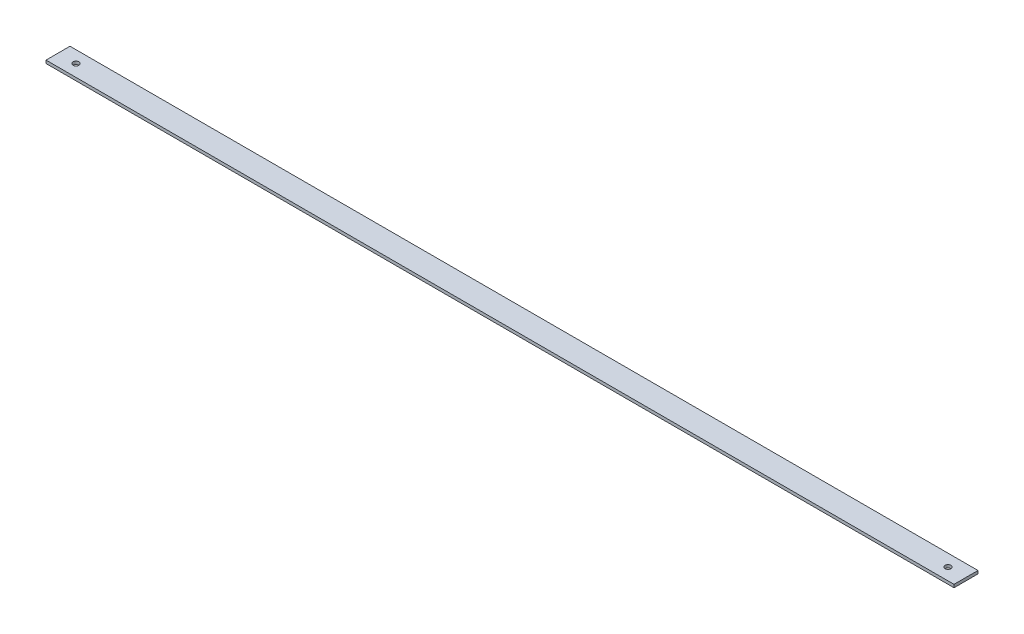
ISO-10303-21;
HEADER;
FILE_DESCRIPTION(('STEP AP214'),'2;1');
FILE_NAME('part.step','',(''),(''),'','','');
FILE_SCHEMA(('AUTOMOTIVE_DESIGN { 1 0 10303 214 1 1 1 1 }'));
ENDSEC;
DATA;
#1=APPLICATION_CONTEXT('core data for automotive mechanical design processes');
#2=APPLICATION_PROTOCOL_DEFINITION('international standard','automotive_design',2000,#1);
#3=PRODUCT_CONTEXT('',#1,'mechanical');
#4=PRODUCT('Part','Part','',(#3));
#5=PRODUCT_RELATED_PRODUCT_CATEGORY('part','',(#4));
#6=PRODUCT_DEFINITION_FORMATION('','',#4);
#7=PRODUCT_DEFINITION_CONTEXT('part definition',#1,'design');
#8=PRODUCT_DEFINITION('design','',#6,#7);
#9=PRODUCT_DEFINITION_SHAPE('','',#8);
#10=(LENGTH_UNIT() NAMED_UNIT(*) SI_UNIT(.MILLI.,.METRE.));
#11=(NAMED_UNIT(*) PLANE_ANGLE_UNIT() SI_UNIT($,.RADIAN.));
#12=(NAMED_UNIT(*) SI_UNIT($,.STERADIAN.) SOLID_ANGLE_UNIT());
#13=UNCERTAINTY_MEASURE_WITH_UNIT(LENGTH_MEASURE(1.E-05),#10,'distance_accuracy_value','');
#14=(GEOMETRIC_REPRESENTATION_CONTEXT(3) GLOBAL_UNCERTAINTY_ASSIGNED_CONTEXT((#13)) GLOBAL_UNIT_ASSIGNED_CONTEXT((#10,
#11,#12)) REPRESENTATION_CONTEXT('',''));
#15=CARTESIAN_POINT('',(0.,0.,0.));
#16=DIRECTION('',(0.,0.,1.));
#17=DIRECTION('',(1.,0.,0.));
#18=AXIS2_PLACEMENT_3D('',#15,#16,#17);
#19=CARTESIAN_POINT('',(480.695,3.175,-12.7));
#20=DIRECTION('',(-1.,0.,0.));
#21=DIRECTION('',(0.,0.,1.));
#22=AXIS2_PLACEMENT_3D('',#19,#20,#21);
#23=PLANE('',#22);
#24=DIRECTION('',(0.,0.,-1.));
#25=VECTOR('',#24,1.);
#26=CARTESIAN_POINT('',(480.695,0.,-12.7));
#27=LINE('',#26,#25);
#28=CARTESIAN_POINT('',(480.695,0.,12.7));
#29=VERTEX_POINT('',#28);
#30=CARTESIAN_POINT('',(480.695,0.,-12.7));
#31=VERTEX_POINT('',#30);
#32=EDGE_CURVE('E108',#29,#31,#27,.T.);
#33=ORIENTED_EDGE('',*,*,#32,.T.);
#34=DIRECTION('',(0.,-1.,0.));
#35=VECTOR('',#34,1.);
#36=CARTESIAN_POINT('',(480.695,3.175,-12.7));
#37=LINE('',#36,#35);
#38=CARTESIAN_POINT('',(480.695,3.175,-12.7));
#39=VERTEX_POINT('',#38);
#40=EDGE_CURVE('E12',#39,#31,#37,.T.);
#41=ORIENTED_EDGE('',*,*,#40,.F.);
#42=DIRECTION('',(0.,0.,-1.));
#43=VECTOR('',#42,1.);
#44=CARTESIAN_POINT('',(480.695,3.175,-12.7));
#45=LINE('',#44,#43);
#46=CARTESIAN_POINT('',(480.695,3.175,12.7));
#47=VERTEX_POINT('',#46);
#48=EDGE_CURVE('E94',#47,#39,#45,.T.);
#49=ORIENTED_EDGE('',*,*,#48,.F.);
#50=DIRECTION('',(0.,-1.,0.));
#51=VECTOR('',#50,1.);
#52=CARTESIAN_POINT('',(480.695,3.175,12.7));
#53=LINE('',#52,#51);
#54=EDGE_CURVE('E103',#47,#29,#53,.T.);
#55=ORIENTED_EDGE('',*,*,#54,.T.);
#56=EDGE_LOOP('',(#33,#41,#49,#55));
#57=FACE_BOUND('',#56,.T.);
#58=ADVANCED_FACE('F43',(#57),#23,.F.);
#59=CARTESIAN_POINT('',(-480.695,3.175,-12.7));
#60=DIRECTION('',(0.,0.,1.));
#61=DIRECTION('',(1.,0.,0.));
#62=AXIS2_PLACEMENT_3D('',#59,#60,#61);
#63=PLANE('',#62);
#64=DIRECTION('',(-1.,0.,0.));
#65=VECTOR('',#64,1.);
#66=CARTESIAN_POINT('',(-480.695,0.,-12.7));
#67=LINE('',#66,#65);
#68=CARTESIAN_POINT('',(-480.695,0.,-12.7));
#69=VERTEX_POINT('',#68);
#70=EDGE_CURVE('E98',#31,#69,#67,.T.);
#71=ORIENTED_EDGE('',*,*,#70,.T.);
#72=DIRECTION('',(0.,-1.,0.));
#73=VECTOR('',#72,1.);
#74=CARTESIAN_POINT('',(-480.695,3.175,-12.7));
#75=LINE('',#74,#73);
#76=CARTESIAN_POINT('',(-480.695,3.175,-12.7));
#77=VERTEX_POINT('',#76);
#78=EDGE_CURVE('E51',#77,#69,#75,.T.);
#79=ORIENTED_EDGE('',*,*,#78,.F.);
#80=DIRECTION('',(-1.,0.,0.));
#81=VECTOR('',#80,1.);
#82=CARTESIAN_POINT('',(-480.695,3.175,-12.7));
#83=LINE('',#82,#81);
#84=EDGE_CURVE('E89',#39,#77,#83,.T.);
#85=ORIENTED_EDGE('',*,*,#84,.F.);
#86=ORIENTED_EDGE('',*,*,#40,.T.);
#87=EDGE_LOOP('',(#71,#79,#85,#86));
#88=FACE_BOUND('',#87,.T.);
#89=ADVANCED_FACE('F97',(#88),#63,.F.);
#90=CARTESIAN_POINT('',(-480.695,3.175,-12.7));
#91=DIRECTION('',(1.,0.,0.));
#92=DIRECTION('',(0.,0.,-1.));
#93=AXIS2_PLACEMENT_3D('',#90,#91,#92);
#94=PLANE('',#93);
#95=DIRECTION('',(0.,0.,1.));
#96=VECTOR('',#95,1.);
#97=CARTESIAN_POINT('',(-480.695,0.,-12.7));
#98=LINE('',#97,#96);
#99=CARTESIAN_POINT('',(-480.695,0.,12.7));
#100=VERTEX_POINT('',#99);
#101=EDGE_CURVE('E76',#69,#100,#98,.T.);
#102=ORIENTED_EDGE('',*,*,#101,.T.);
#103=DIRECTION('',(0.,-1.,0.));
#104=VECTOR('',#103,1.);
#105=CARTESIAN_POINT('',(-480.695,3.175,12.7));
#106=LINE('',#105,#104);
#107=CARTESIAN_POINT('',(-480.695,3.175,12.7));
#108=VERTEX_POINT('',#107);
#109=EDGE_CURVE('E99',#108,#100,#106,.T.);
#110=ORIENTED_EDGE('',*,*,#109,.F.);
#111=DIRECTION('',(0.,0.,1.));
#112=VECTOR('',#111,1.);
#113=CARTESIAN_POINT('',(-480.695,3.175,-12.7));
#114=LINE('',#113,#112);
#115=EDGE_CURVE('E92',#77,#108,#114,.T.);
#116=ORIENTED_EDGE('',*,*,#115,.F.);
#117=ORIENTED_EDGE('',*,*,#78,.T.);
#118=EDGE_LOOP('',(#102,#110,#116,#117));
#119=FACE_BOUND('',#118,.T.);
#120=ADVANCED_FACE('F100',(#119),#94,.F.);
#121=CARTESIAN_POINT('',(-480.695,3.175,12.7));
#122=DIRECTION('',(0.,0.,-1.));
#123=DIRECTION('',(-1.,0.,0.));
#124=AXIS2_PLACEMENT_3D('',#121,#122,#123);
#125=PLANE('',#124);
#126=DIRECTION('',(1.,0.,0.));
#127=VECTOR('',#126,1.);
#128=CARTESIAN_POINT('',(-480.695,0.,12.7));
#129=LINE('',#128,#127);
#130=EDGE_CURVE('E82',#100,#29,#129,.T.);
#131=ORIENTED_EDGE('',*,*,#130,.T.);
#132=ORIENTED_EDGE('',*,*,#54,.F.);
#133=DIRECTION('',(1.,0.,0.));
#134=VECTOR('',#133,1.);
#135=CARTESIAN_POINT('',(-480.695,3.175,12.7));
#136=LINE('',#135,#134);
#137=EDGE_CURVE('E59',#108,#47,#136,.T.);
#138=ORIENTED_EDGE('',*,*,#137,.F.);
#139=ORIENTED_EDGE('',*,*,#109,.T.);
#140=EDGE_LOOP('',(#131,#132,#138,#139));
#141=FACE_BOUND('',#140,.T.);
#142=ADVANCED_FACE('F123',(#141),#125,.F.);
#143=CARTESIAN_POINT('',(0.,3.175,0.));
#144=DIRECTION('',(0.,1.,0.));
#145=DIRECTION('',(0.,0.,1.));
#146=AXIS2_PLACEMENT_3D('',#143,#144,#145);
#147=PLANE('',#146);
#148=CARTESIAN_POINT('',(-461.645,3.175,0.));
#149=DIRECTION('',(0.,1.,0.));
#150=DIRECTION('',(0.,0.,1.));
#151=AXIS2_PLACEMENT_3D('',#148,#149,#150);
#152=CIRCLE('',#151,3.17499999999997);
#153=CARTESIAN_POINT('',(-461.645,3.175,3.17499999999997));
#154=VERTEX_POINT('',#153);
#155=EDGE_CURVE('E198',#154,#154,#152,.T.);
#156=ORIENTED_EDGE('',*,*,#155,.F.);
#157=EDGE_LOOP('',(#156));
#158=FACE_BOUND('',#157,.T.);
#159=CARTESIAN_POINT('',(461.645,3.175,0.));
#160=DIRECTION('',(0.,1.,0.));
#161=DIRECTION('',(0.,0.,1.));
#162=AXIS2_PLACEMENT_3D('',#159,#160,#161);
#163=CIRCLE('',#162,3.17499999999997);
#164=CARTESIAN_POINT('',(461.645,3.175,3.17499999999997));
#165=VERTEX_POINT('',#164);
#166=EDGE_CURVE('E112',#165,#165,#163,.T.);
#167=ORIENTED_EDGE('',*,*,#166,.F.);
#168=EDGE_LOOP('',(#167));
#169=FACE_BOUND('',#168,.T.);
#170=ORIENTED_EDGE('',*,*,#48,.T.);
#171=ORIENTED_EDGE('',*,*,#84,.T.);
#172=ORIENTED_EDGE('',*,*,#115,.T.);
#173=ORIENTED_EDGE('',*,*,#137,.T.);
#174=EDGE_LOOP('',(#170,#171,#172,#173));
#175=FACE_BOUND('',#174,.T.);
#176=ADVANCED_FACE('F90',(#158,#169,#175),#147,.T.);
#177=CARTESIAN_POINT('',(0.,0.,0.));
#178=DIRECTION('',(0.,1.,0.));
#179=DIRECTION('',(0.,0.,1.));
#180=AXIS2_PLACEMENT_3D('',#177,#178,#179);
#181=PLANE('',#180);
#182=CARTESIAN_POINT('',(-461.645,0.,0.));
#183=DIRECTION('',(0.,1.,0.));
#184=DIRECTION('',(0.,0.,1.));
#185=AXIS2_PLACEMENT_3D('',#182,#183,#184);
#186=CIRCLE('',#185,3.17499999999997);
#187=CARTESIAN_POINT('',(-461.645,0.,3.17499999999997));
#188=VERTEX_POINT('',#187);
#189=EDGE_CURVE('E118',#188,#188,#186,.T.);
#190=ORIENTED_EDGE('',*,*,#189,.T.);
#191=EDGE_LOOP('',(#190));
#192=FACE_BOUND('',#191,.T.);
#193=CARTESIAN_POINT('',(461.645,0.,0.));
#194=DIRECTION('',(0.,1.,0.));
#195=DIRECTION('',(0.,0.,1.));
#196=AXIS2_PLACEMENT_3D('',#193,#194,#195);
#197=CIRCLE('',#196,3.17499999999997);
#198=CARTESIAN_POINT('',(461.645,0.,3.17499999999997));
#199=VERTEX_POINT('',#198);
#200=EDGE_CURVE('E117',#199,#199,#197,.T.);
#201=ORIENTED_EDGE('',*,*,#200,.T.);
#202=EDGE_LOOP('',(#201));
#203=FACE_BOUND('',#202,.T.);
#204=ORIENTED_EDGE('',*,*,#32,.F.);
#205=ORIENTED_EDGE('',*,*,#130,.F.);
#206=ORIENTED_EDGE('',*,*,#101,.F.);
#207=ORIENTED_EDGE('',*,*,#70,.F.);
#208=EDGE_LOOP('',(#204,#205,#206,#207));
#209=FACE_BOUND('',#208,.T.);
#210=ADVANCED_FACE('F126',(#192,#203,#209),#181,.F.);
#211=CARTESIAN_POINT('',(461.645,0.,0.));
#212=DIRECTION('',(0.,1.,0.));
#213=DIRECTION('',(0.,0.,1.));
#214=AXIS2_PLACEMENT_3D('',#211,#212,#213);
#215=CYLINDRICAL_SURFACE('',#214,3.17499999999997);
#216=ORIENTED_EDGE('',*,*,#200,.F.);
#217=EDGE_LOOP('',(#216));
#218=FACE_BOUND('',#217,.T.);
#219=ORIENTED_EDGE('',*,*,#166,.T.);
#220=EDGE_LOOP('',(#219));
#221=FACE_BOUND('',#220,.T.);
#222=ADVANCED_FACE('F133',(#218,#221),#215,.F.);
#223=CARTESIAN_POINT('',(-461.645,0.,0.));
#224=DIRECTION('',(0.,1.,0.));
#225=DIRECTION('',(0.,0.,1.));
#226=AXIS2_PLACEMENT_3D('',#223,#224,#225);
#227=CYLINDRICAL_SURFACE('',#226,3.17499999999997);
#228=ORIENTED_EDGE('',*,*,#189,.F.);
#229=EDGE_LOOP('',(#228));
#230=FACE_BOUND('',#229,.T.);
#231=ORIENTED_EDGE('',*,*,#155,.T.);
#232=EDGE_LOOP('',(#231));
#233=FACE_BOUND('',#232,.T.);
#234=ADVANCED_FACE('F136',(#230,#233),#227,.F.);
#235=CLOSED_SHELL('',(#58,#89,#120,#142,#176,#210,#222,#234));
#236=MANIFOLD_SOLID_BREP('B2',#235);
#237=ADVANCED_BREP_SHAPE_REPRESENTATION('',(#18,#236),#14);
#238=SHAPE_DEFINITION_REPRESENTATION(#9,#237);
ENDSEC;
END-ISO-10303-21;
